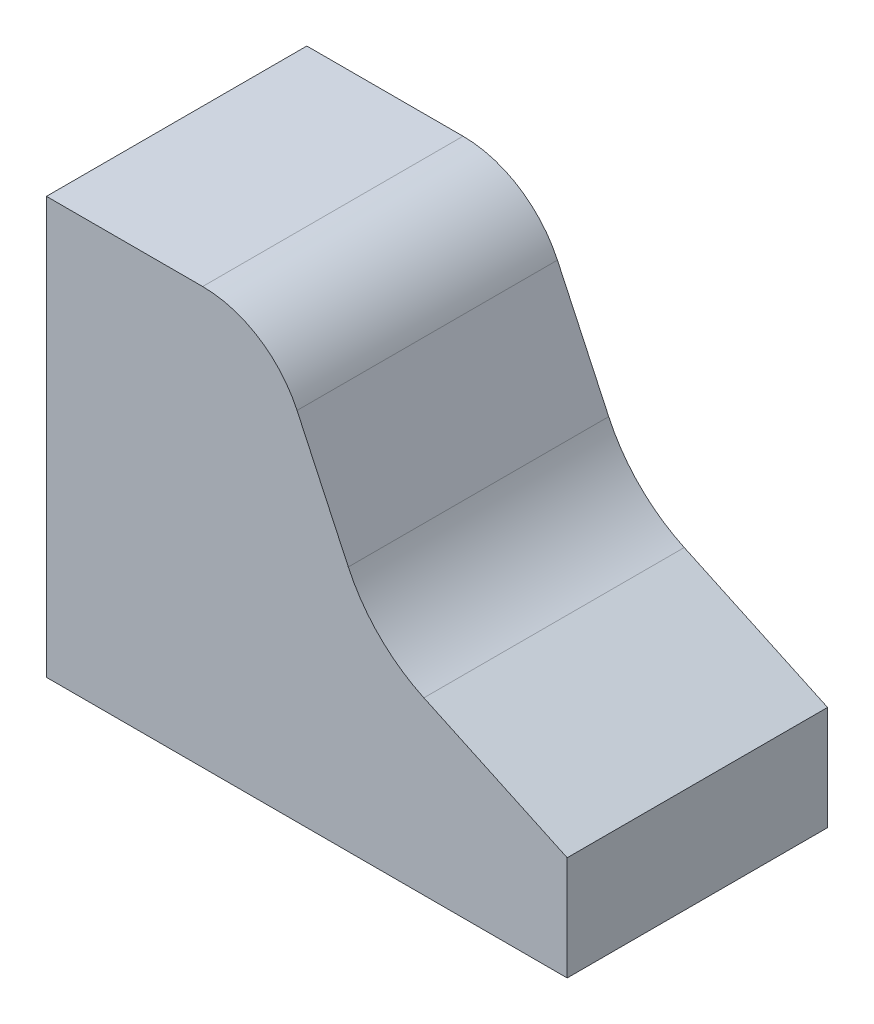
ISO-10303-21;
HEADER;
FILE_DESCRIPTION(('STEP AP214'),'2;1');
FILE_NAME('part.step','',(''),(''),'','','');
FILE_SCHEMA(('AUTOMOTIVE_DESIGN { 1 0 10303 214 1 1 1 1 }'));
ENDSEC;
DATA;
#1=APPLICATION_CONTEXT('core data for automotive mechanical design processes');
#2=APPLICATION_PROTOCOL_DEFINITION('international standard','automotive_design',2000,#1);
#3=PRODUCT_CONTEXT('',#1,'mechanical');
#4=PRODUCT('Part','Part','',(#3));
#5=PRODUCT_RELATED_PRODUCT_CATEGORY('part','',(#4));
#6=PRODUCT_DEFINITION_FORMATION('','',#4);
#7=PRODUCT_DEFINITION_CONTEXT('part definition',#1,'design');
#8=PRODUCT_DEFINITION('design','',#6,#7);
#9=PRODUCT_DEFINITION_SHAPE('','',#8);
#10=(LENGTH_UNIT() NAMED_UNIT(*) SI_UNIT(.MILLI.,.METRE.));
#11=(NAMED_UNIT(*) PLANE_ANGLE_UNIT() SI_UNIT($,.RADIAN.));
#12=(NAMED_UNIT(*) SI_UNIT($,.STERADIAN.) SOLID_ANGLE_UNIT());
#13=UNCERTAINTY_MEASURE_WITH_UNIT(LENGTH_MEASURE(1.E-05),#10,'distance_accuracy_value','');
#14=(GEOMETRIC_REPRESENTATION_CONTEXT(3) GLOBAL_UNCERTAINTY_ASSIGNED_CONTEXT((#13)) GLOBAL_UNIT_ASSIGNED_CONTEXT((#10,
#11,#12)) REPRESENTATION_CONTEXT('',''));
#15=CARTESIAN_POINT('',(0.,0.,0.));
#16=DIRECTION('',(0.,0.,1.));
#17=DIRECTION('',(1.,0.,0.));
#18=AXIS2_PLACEMENT_3D('',#15,#16,#17);
#19=CARTESIAN_POINT('',(0.,0.,63.5));
#20=DIRECTION('',(0.,1.,0.));
#21=DIRECTION('',(0.,0.,1.));
#22=AXIS2_PLACEMENT_3D('',#19,#20,#21);
#23=PLANE('',#22);
#24=DIRECTION('',(1.,0.,0.));
#25=VECTOR('',#24,1.);
#26=CARTESIAN_POINT('',(0.,0.,0.));
#27=LINE('',#26,#25);
#28=CARTESIAN_POINT('',(0.,0.,0.));
#29=VERTEX_POINT('',#28);
#30=CARTESIAN_POINT('',(127.,0.,0.));
#31=VERTEX_POINT('',#30);
#32=EDGE_CURVE('E128',#29,#31,#27,.T.);
#33=ORIENTED_EDGE('',*,*,#32,.T.);
#34=DIRECTION('',(0.,0.,-1.));
#35=VECTOR('',#34,1.);
#36=CARTESIAN_POINT('',(127.,0.,63.5));
#37=LINE('',#36,#35);
#38=CARTESIAN_POINT('',(127.,0.,63.5));
#39=VERTEX_POINT('',#38);
#40=EDGE_CURVE('E11',#39,#31,#37,.T.);
#41=ORIENTED_EDGE('',*,*,#40,.F.);
#42=DIRECTION('',(1.,0.,0.));
#43=VECTOR('',#42,1.);
#44=CARTESIAN_POINT('',(0.,0.,63.5));
#45=LINE('',#44,#43);
#46=CARTESIAN_POINT('',(0.,0.,63.5));
#47=VERTEX_POINT('',#46);
#48=EDGE_CURVE('E142',#47,#39,#45,.T.);
#49=ORIENTED_EDGE('',*,*,#48,.F.);
#50=DIRECTION('',(0.,0.,-1.));
#51=VECTOR('',#50,1.);
#52=CARTESIAN_POINT('',(0.,0.,63.5));
#53=LINE('',#52,#51);
#54=EDGE_CURVE('E124',#47,#29,#53,.T.);
#55=ORIENTED_EDGE('',*,*,#54,.T.);
#56=EDGE_LOOP('',(#33,#41,#49,#55));
#57=FACE_BOUND('',#56,.T.);
#58=ADVANCED_FACE('F32',(#57),#23,.F.);
#59=CARTESIAN_POINT('',(127.,0.,63.5));
#60=DIRECTION('',(-1.,0.,0.));
#61=DIRECTION('',(0.,0.,1.));
#62=AXIS2_PLACEMENT_3D('',#59,#60,#61);
#63=PLANE('',#62);
#64=DIRECTION('',(0.,1.,0.));
#65=VECTOR('',#64,1.);
#66=CARTESIAN_POINT('',(127.,0.,0.));
#67=LINE('',#66,#65);
#68=CARTESIAN_POINT('',(127.,25.4,0.));
#69=VERTEX_POINT('',#68);
#70=EDGE_CURVE('E131',#31,#69,#67,.T.);
#71=ORIENTED_EDGE('',*,*,#70,.T.);
#72=DIRECTION('',(0.,0.,-1.));
#73=VECTOR('',#72,1.);
#74=CARTESIAN_POINT('',(127.,25.4,63.5));
#75=LINE('',#74,#73);
#76=CARTESIAN_POINT('',(127.,25.4,63.5));
#77=VERTEX_POINT('',#76);
#78=EDGE_CURVE('E40',#77,#69,#75,.T.);
#79=ORIENTED_EDGE('',*,*,#78,.F.);
#80=DIRECTION('',(0.,1.,0.));
#81=VECTOR('',#80,1.);
#82=CARTESIAN_POINT('',(127.,0.,63.5));
#83=LINE('',#82,#81);
#84=EDGE_CURVE('E91',#39,#77,#83,.T.);
#85=ORIENTED_EDGE('',*,*,#84,.F.);
#86=ORIENTED_EDGE('',*,*,#40,.T.);
#87=EDGE_LOOP('',(#71,#79,#85,#86));
#88=FACE_BOUND('',#87,.T.);
#89=ADVANCED_FACE('F177',(#88),#63,.F.);
#90=CARTESIAN_POINT('',(127.,25.4,63.5));
#91=DIRECTION('',(-0.422618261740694,-0.906307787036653,0.));
#92=DIRECTION('',(0.906307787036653,-0.422618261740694,0.));
#93=AXIS2_PLACEMENT_3D('',#90,#91,#92);
#94=PLANE('',#93);
#95=DIRECTION('',(-0.906307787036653,0.422618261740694,0.));
#96=VECTOR('',#95,1.);
#97=CARTESIAN_POINT('',(127.,25.4,0.));
#98=LINE('',#97,#96);
#99=CARTESIAN_POINT('',(92.0497295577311,41.697578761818,0.));
#100=VERTEX_POINT('',#99);
#101=EDGE_CURVE('E133',#69,#100,#98,.T.);
#102=ORIENTED_EDGE('',*,*,#101,.T.);
#103=DIRECTION('',(0.,0.,-1.));
#104=VECTOR('',#103,1.);
#105=CARTESIAN_POINT('',(92.0497295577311,41.697578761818,63.5));
#106=LINE('',#105,#104);
#107=CARTESIAN_POINT('',(92.0497295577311,41.697578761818,63.5));
#108=VERTEX_POINT('',#107);
#109=EDGE_CURVE('E149',#108,#100,#106,.T.);
#110=ORIENTED_EDGE('',*,*,#109,.F.);
#111=DIRECTION('',(-0.906307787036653,0.422618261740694,0.));
#112=VECTOR('',#111,1.);
#113=CARTESIAN_POINT('',(127.,25.4,63.5));
#114=LINE('',#113,#112);
#115=EDGE_CURVE('E157',#77,#108,#114,.T.);
#116=ORIENTED_EDGE('',*,*,#115,.F.);
#117=ORIENTED_EDGE('',*,*,#78,.T.);
#118=EDGE_LOOP('',(#102,#110,#116,#117));
#119=FACE_BOUND('',#118,.T.);
#120=ADVANCED_FACE('F155',(#119),#94,.F.);
#121=CARTESIAN_POINT('',(108.151485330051,76.2279054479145,63.5));
#122=DIRECTION('',(0.,0.,-1.));
#123=DIRECTION('',(-1.,0.,0.));
#124=AXIS2_PLACEMENT_3D('',#121,#122,#123);
#125=CYLINDRICAL_SURFACE('',#124,38.1);
#126=CARTESIAN_POINT('',(108.151485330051,76.2279054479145,0.));
#127=DIRECTION('',(0.,0.,-1.));
#128=DIRECTION('',(-1.,0.,0.));
#129=AXIS2_PLACEMENT_3D('',#126,#127,#128);
#130=CIRCLE('',#129,38.1);
#131=CARTESIAN_POINT('',(73.6211586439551,60.1261496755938,0.));
#132=VERTEX_POINT('',#131);
#133=EDGE_CURVE('E135',#100,#132,#130,.T.);
#134=ORIENTED_EDGE('',*,*,#133,.T.);
#135=DIRECTION('',(0.,0.,-1.));
#136=VECTOR('',#135,1.);
#137=CARTESIAN_POINT('',(73.6211586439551,60.1261496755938,63.5));
#138=LINE('',#137,#136);
#139=CARTESIAN_POINT('',(73.6211586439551,60.1261496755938,63.5));
#140=VERTEX_POINT('',#139);
#141=EDGE_CURVE('E146',#140,#132,#138,.T.);
#142=ORIENTED_EDGE('',*,*,#141,.F.);
#143=CARTESIAN_POINT('',(108.151485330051,76.2279054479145,63.5));
#144=DIRECTION('',(0.,0.,-1.));
#145=DIRECTION('',(-1.,0.,0.));
#146=AXIS2_PLACEMENT_3D('',#143,#144,#145);
#147=CIRCLE('',#146,38.1);
#148=EDGE_CURVE('E169',#108,#140,#147,.T.);
#149=ORIENTED_EDGE('',*,*,#148,.F.);
#150=ORIENTED_EDGE('',*,*,#109,.T.);
#151=EDGE_LOOP('',(#134,#142,#149,#150));
#152=FACE_BOUND('',#151,.T.);
#153=ADVANCED_FACE('F165',(#152),#125,.F.);
#154=CARTESIAN_POINT('',(73.6211586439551,60.1261496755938,63.5));
#155=DIRECTION('',(-0.90630778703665,-0.4226182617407,0.));
#156=DIRECTION('',(0.4226182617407,-0.90630778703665,0.));
#157=AXIS2_PLACEMENT_3D('',#154,#155,#156);
#158=PLANE('',#157);
#159=DIRECTION('',(-0.4226182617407,0.906307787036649,0.));
#160=VECTOR('',#159,1.);
#161=CARTESIAN_POINT('',(73.6211586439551,60.1261496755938,0.));
#162=LINE('',#161,#160);
#163=CARTESIAN_POINT('',(61.1202177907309,86.9345038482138,0.));
#164=VERTEX_POINT('',#163);
#165=EDGE_CURVE('E137',#132,#164,#162,.T.);
#166=ORIENTED_EDGE('',*,*,#165,.T.);
#167=DIRECTION('',(0.,0.,-1.));
#168=VECTOR('',#167,1.);
#169=CARTESIAN_POINT('',(61.1202177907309,86.9345038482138,63.5));
#170=LINE('',#169,#168);
#171=CARTESIAN_POINT('',(61.1202177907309,86.9345038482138,63.5));
#172=VERTEX_POINT('',#171);
#173=EDGE_CURVE('E119',#172,#164,#170,.T.);
#174=ORIENTED_EDGE('',*,*,#173,.F.);
#175=DIRECTION('',(-0.4226182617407,0.906307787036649,0.));
#176=VECTOR('',#175,1.);
#177=CARTESIAN_POINT('',(73.6211586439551,60.1261496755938,63.5));
#178=LINE('',#177,#176);
#179=EDGE_CURVE('E110',#140,#172,#178,.T.);
#180=ORIENTED_EDGE('',*,*,#179,.F.);
#181=ORIENTED_EDGE('',*,*,#141,.T.);
#182=EDGE_LOOP('',(#166,#174,#180,#181));
#183=FACE_BOUND('',#182,.T.);
#184=ADVANCED_FACE('F168',(#183),#158,.F.);
#185=CARTESIAN_POINT('',(38.1,76.2,63.5));
#186=DIRECTION('',(0.,0.,-1.));
#187=DIRECTION('',(-1.,0.,0.));
#188=AXIS2_PLACEMENT_3D('',#185,#186,#187);
#189=CYLINDRICAL_SURFACE('',#188,25.4);
#190=CARTESIAN_POINT('',(38.1,76.2,0.));
#191=DIRECTION('',(0.,0.,1.));
#192=DIRECTION('',(1.,0.,0.));
#193=AXIS2_PLACEMENT_3D('',#190,#191,#192);
#194=CIRCLE('',#193,25.4);
#195=CARTESIAN_POINT('',(38.1,101.6,0.));
#196=VERTEX_POINT('',#195);
#197=EDGE_CURVE('E118',#164,#196,#194,.T.);
#198=ORIENTED_EDGE('',*,*,#197,.T.);
#199=DIRECTION('',(0.,0.,-1.));
#200=VECTOR('',#199,1.);
#201=CARTESIAN_POINT('',(38.1,101.6,63.5));
#202=LINE('',#201,#200);
#203=CARTESIAN_POINT('',(38.1,101.6,63.5));
#204=VERTEX_POINT('',#203);
#205=EDGE_CURVE('E115',#204,#196,#202,.T.);
#206=ORIENTED_EDGE('',*,*,#205,.F.);
#207=CARTESIAN_POINT('',(38.1,76.2,63.5));
#208=DIRECTION('',(0.,0.,1.));
#209=DIRECTION('',(1.,0.,0.));
#210=AXIS2_PLACEMENT_3D('',#207,#208,#209);
#211=CIRCLE('',#210,25.4);
#212=EDGE_CURVE('E104',#172,#204,#211,.T.);
#213=ORIENTED_EDGE('',*,*,#212,.F.);
#214=ORIENTED_EDGE('',*,*,#173,.T.);
#215=EDGE_LOOP('',(#198,#206,#213,#214));
#216=FACE_BOUND('',#215,.T.);
#217=ADVANCED_FACE('F116',(#216),#189,.T.);
#218=CARTESIAN_POINT('',(38.1,101.6,63.5));
#219=DIRECTION('',(0.,-1.,0.));
#220=DIRECTION('',(0.,0.,-1.));
#221=AXIS2_PLACEMENT_3D('',#218,#219,#220);
#222=PLANE('',#221);
#223=DIRECTION('',(-1.,0.,0.));
#224=VECTOR('',#223,1.);
#225=CARTESIAN_POINT('',(38.1,101.6,0.));
#226=LINE('',#225,#224);
#227=CARTESIAN_POINT('',(0.,101.6,0.));
#228=VERTEX_POINT('',#227);
#229=EDGE_CURVE('E77',#196,#228,#226,.T.);
#230=ORIENTED_EDGE('',*,*,#229,.T.);
#231=DIRECTION('',(0.,0.,-1.));
#232=VECTOR('',#231,1.);
#233=CARTESIAN_POINT('',(0.,101.6,63.5));
#234=LINE('',#233,#232);
#235=CARTESIAN_POINT('',(0.,101.6,63.5));
#236=VERTEX_POINT('',#235);
#237=EDGE_CURVE('E120',#236,#228,#234,.T.);
#238=ORIENTED_EDGE('',*,*,#237,.F.);
#239=DIRECTION('',(-1.,0.,0.));
#240=VECTOR('',#239,1.);
#241=CARTESIAN_POINT('',(38.1,101.6,63.5));
#242=LINE('',#241,#240);
#243=EDGE_CURVE('E108',#204,#236,#242,.T.);
#244=ORIENTED_EDGE('',*,*,#243,.F.);
#245=ORIENTED_EDGE('',*,*,#205,.T.);
#246=EDGE_LOOP('',(#230,#238,#244,#245));
#247=FACE_BOUND('',#246,.T.);
#248=ADVANCED_FACE('F122',(#247),#222,.F.);
#249=CARTESIAN_POINT('',(0.,0.,63.5));
#250=DIRECTION('',(1.,0.,0.));
#251=DIRECTION('',(0.,0.,-1.));
#252=AXIS2_PLACEMENT_3D('',#249,#250,#251);
#253=PLANE('',#252);
#254=DIRECTION('',(0.,-1.,0.));
#255=VECTOR('',#254,1.);
#256=CARTESIAN_POINT('',(0.,0.,0.));
#257=LINE('',#256,#255);
#258=EDGE_CURVE('E83',#228,#29,#257,.T.);
#259=ORIENTED_EDGE('',*,*,#258,.T.);
#260=ORIENTED_EDGE('',*,*,#54,.F.);
#261=DIRECTION('',(0.,-1.,0.));
#262=VECTOR('',#261,1.);
#263=CARTESIAN_POINT('',(0.,0.,63.5));
#264=LINE('',#263,#262);
#265=EDGE_CURVE('E48',#236,#47,#264,.T.);
#266=ORIENTED_EDGE('',*,*,#265,.F.);
#267=ORIENTED_EDGE('',*,*,#237,.T.);
#268=EDGE_LOOP('',(#259,#260,#266,#267));
#269=FACE_BOUND('',#268,.T.);
#270=ADVANCED_FACE('F193',(#269),#253,.F.);
#271=CARTESIAN_POINT('',(108.151485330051,76.2279054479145,63.5));
#272=DIRECTION('',(0.,0.,-1.));
#273=DIRECTION('',(-1.,0.,0.));
#274=AXIS2_PLACEMENT_3D('',#271,#272,#273);
#275=PLANE('',#274);
#276=ORIENTED_EDGE('',*,*,#48,.T.);
#277=ORIENTED_EDGE('',*,*,#84,.T.);
#278=ORIENTED_EDGE('',*,*,#115,.T.);
#279=ORIENTED_EDGE('',*,*,#148,.T.);
#280=ORIENTED_EDGE('',*,*,#179,.T.);
#281=ORIENTED_EDGE('',*,*,#212,.T.);
#282=ORIENTED_EDGE('',*,*,#243,.T.);
#283=ORIENTED_EDGE('',*,*,#265,.T.);
#284=EDGE_LOOP('',(#276,#277,#278,#279,#280,#281,#282,#283));
#285=FACE_BOUND('',#284,.T.);
#286=ADVANCED_FACE('F106',(#285),#275,.F.);
#287=CARTESIAN_POINT('',(108.151485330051,76.2279054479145,0.));
#288=DIRECTION('',(0.,0.,-1.));
#289=DIRECTION('',(-1.,0.,0.));
#290=AXIS2_PLACEMENT_3D('',#287,#288,#289);
#291=PLANE('',#290);
#292=ORIENTED_EDGE('',*,*,#32,.F.);
#293=ORIENTED_EDGE('',*,*,#258,.F.);
#294=ORIENTED_EDGE('',*,*,#229,.F.);
#295=ORIENTED_EDGE('',*,*,#197,.F.);
#296=ORIENTED_EDGE('',*,*,#165,.F.);
#297=ORIENTED_EDGE('',*,*,#133,.F.);
#298=ORIENTED_EDGE('',*,*,#101,.F.);
#299=ORIENTED_EDGE('',*,*,#70,.F.);
#300=EDGE_LOOP('',(#292,#293,#294,#295,#296,#297,#298,#299));
#301=FACE_BOUND('',#300,.T.);
#302=ADVANCED_FACE('F161',(#301),#291,.T.);
#303=CLOSED_SHELL('',(#58,#89,#120,#153,#184,#217,#248,#270,#286,#302));
#304=MANIFOLD_SOLID_BREP('B2',#303);
#305=ADVANCED_BREP_SHAPE_REPRESENTATION('',(#18,#304),#14);
#306=SHAPE_DEFINITION_REPRESENTATION(#9,#305);
ENDSEC;
END-ISO-10303-21;
